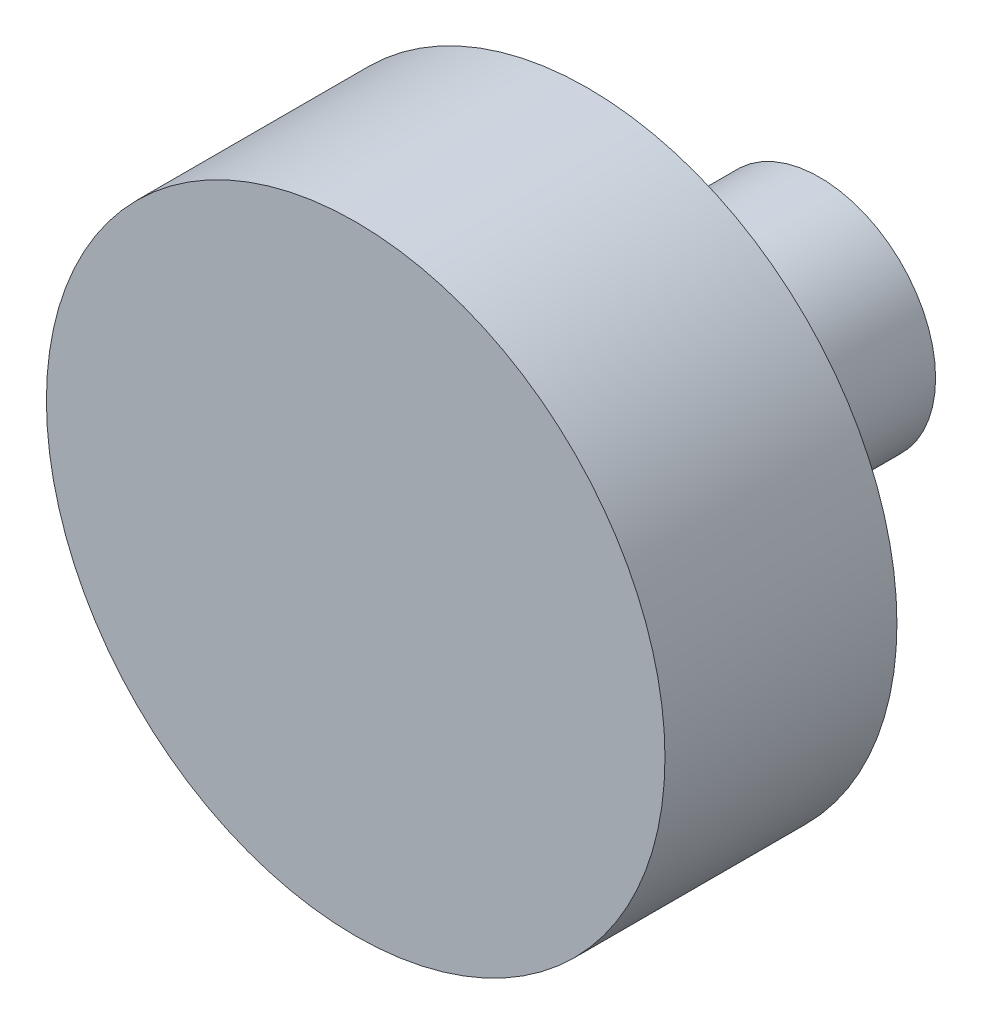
from build123d import *

# Parameters (mm, degrees)
SKETCH1_R           = 101.6
BOSS_EXTRUDE1_DEPTH = 76.2
SKETCH2_R           = 38.1
BOSS_EXTRUDE2_DEPTH = 76.2
SKETCH2_3_R         = 38.1
BOSS_EXTRUDE3_DEPTH = 76.2


with BuildPart() as part:
    # Sketch1 → Boss-Extrude1 (new body)
    with BuildSketch(Plane.XY):
        with Locations(Location((0, 0, 0), (0, 0, 180))):
            Circle(SKETCH1_R)
    extrude(amount=BOSS_EXTRUDE1_DEPTH)

    # Sketch2 → Boss-Extrude2 (add)
    with BuildSketch(Plane.XY):
        Circle(SKETCH2_R)
    extrude(amount=BOSS_EXTRUDE2_DEPTH)

    # Sketch2_3 → Boss-Extrude3 (add)
    with BuildSketch(Plane.XY):
        Circle(SKETCH2_3_R)
    extrude(amount=-BOSS_EXTRUDE3_DEPTH)


solid = part.part
